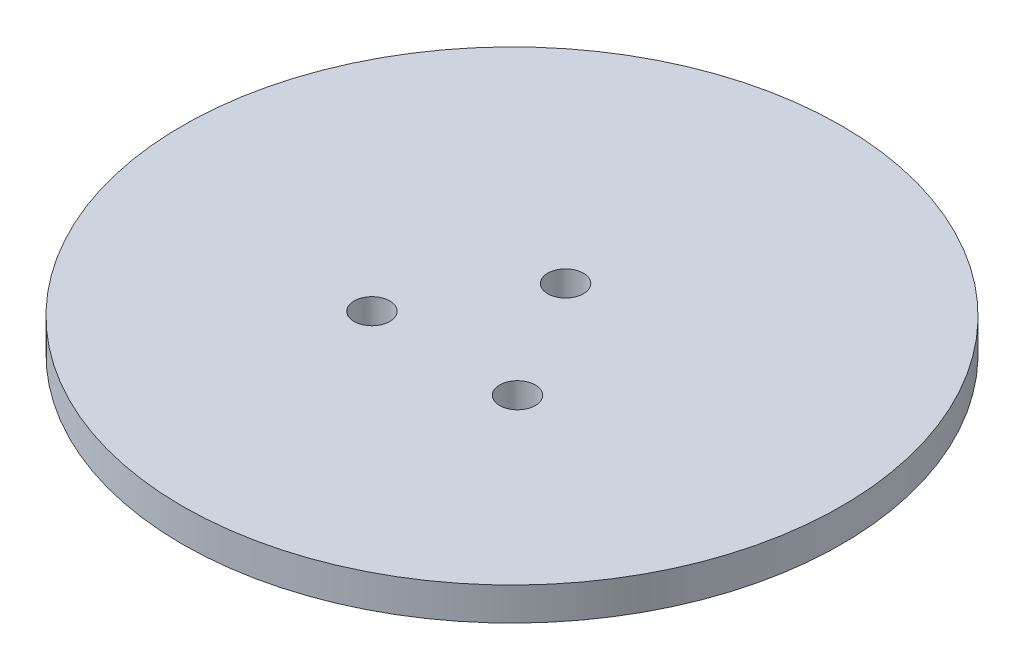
from build123d import *

# Parameters (mm, degrees)
SKETCH1_R      = 60.96
SKETCH1_R_2    = 3.302
EXTRUDE1_DEPTH = 6.096


with BuildPart() as part:
    # Sketch1 → Extrude1 (new body)
    with BuildSketch(Plane(origin=(0, 0, 0), x_dir=(1, 0, 0), z_dir=(0, 1, 0))):
        with Locations(Location((0, 0, 0), (0, 0, 90))):
            Circle(SKETCH1_R)
        with Locations(Location((-0.254, 10.16, 0), (0, 0, 90))):
            Circle(SKETCH1_R_2, mode=Mode.SUBTRACT)
        with Locations(Location((-13.716, -12.192, 0), (0, 0, 90))):
            Circle(SKETCH1_R_2, mode=Mode.SUBTRACT)
        with Locations(Location((13.208, -12.192, 0), (0, 0, 90))):
            Circle(SKETCH1_R_2, mode=Mode.SUBTRACT)
    extrude(amount=EXTRUDE1_DEPTH)


solid = part.part
